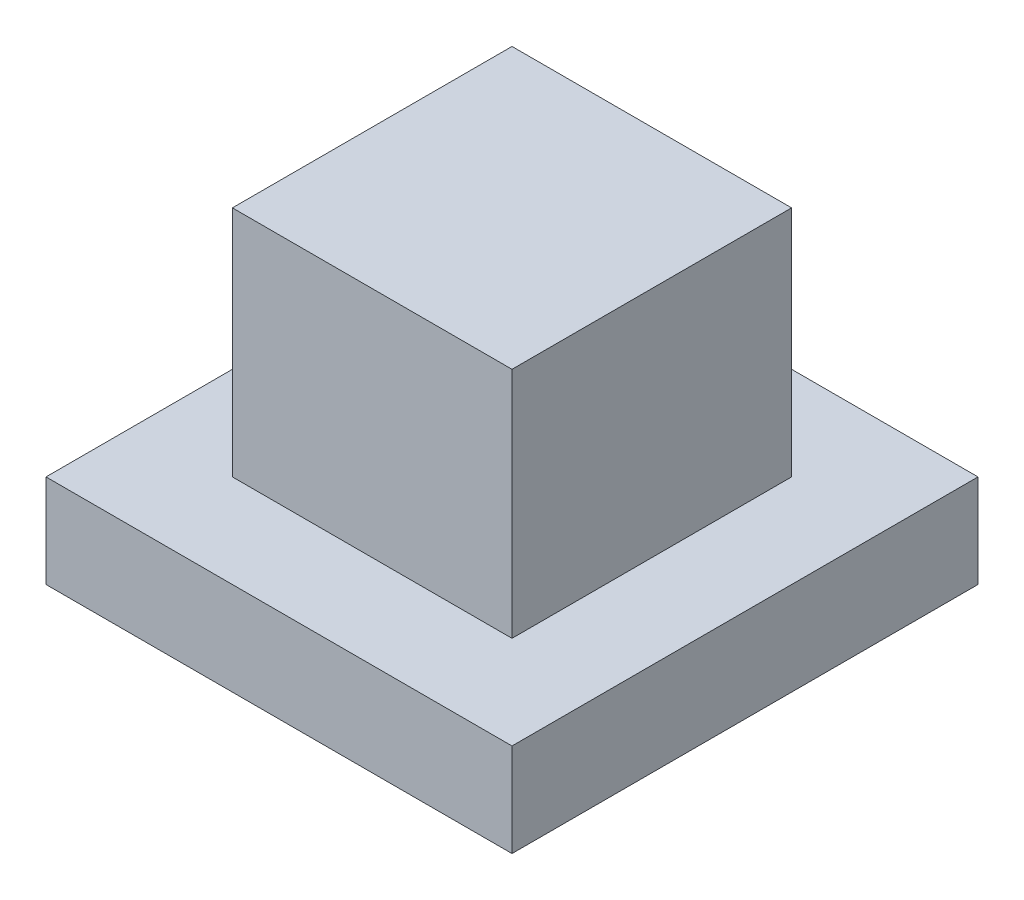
ISO-10303-21;
HEADER;
FILE_DESCRIPTION(('STEP AP214'),'2;1');
FILE_NAME('part.step','',(''),(''),'','','');
FILE_SCHEMA(('AUTOMOTIVE_DESIGN { 1 0 10303 214 1 1 1 1 }'));
ENDSEC;
DATA;
#1=APPLICATION_CONTEXT('core data for automotive mechanical design processes');
#2=APPLICATION_PROTOCOL_DEFINITION('international standard','automotive_design',2000,#1);
#3=PRODUCT_CONTEXT('',#1,'mechanical');
#4=PRODUCT('Part','Part','',(#3));
#5=PRODUCT_RELATED_PRODUCT_CATEGORY('part','',(#4));
#6=PRODUCT_DEFINITION_FORMATION('','',#4);
#7=PRODUCT_DEFINITION_CONTEXT('part definition',#1,'design');
#8=PRODUCT_DEFINITION('design','',#6,#7);
#9=PRODUCT_DEFINITION_SHAPE('','',#8);
#10=(LENGTH_UNIT() NAMED_UNIT(*) SI_UNIT(.MILLI.,.METRE.));
#11=(NAMED_UNIT(*) PLANE_ANGLE_UNIT() SI_UNIT($,.RADIAN.));
#12=(NAMED_UNIT(*) SI_UNIT($,.STERADIAN.) SOLID_ANGLE_UNIT());
#13=UNCERTAINTY_MEASURE_WITH_UNIT(LENGTH_MEASURE(1.E-05),#10,'distance_accuracy_value','');
#14=(GEOMETRIC_REPRESENTATION_CONTEXT(3) GLOBAL_UNCERTAINTY_ASSIGNED_CONTEXT((#13)) GLOBAL_UNIT_ASSIGNED_CONTEXT((#10,
#11,#12)) REPRESENTATION_CONTEXT('',''));
#15=CARTESIAN_POINT('',(0.,0.,0.));
#16=DIRECTION('',(0.,0.,1.));
#17=DIRECTION('',(1.,0.,0.));
#18=AXIS2_PLACEMENT_3D('',#15,#16,#17);
#19=CARTESIAN_POINT('',(-50.,20.,50.));
#20=DIRECTION('',(0.,-1.,0.));
#21=DIRECTION('',(1.,0.,0.));
#22=AXIS2_PLACEMENT_3D('',#19,#20,#21);
#23=PLANE('',#22);
#24=DIRECTION('',(-1.,0.,0.));
#25=VECTOR('',#24,1.);
#26=CARTESIAN_POINT('',(-50.,20.,-50.));
#27=LINE('',#26,#25);
#28=CARTESIAN_POINT('',(50.,20.,-50.));
#29=VERTEX_POINT('',#28);
#30=CARTESIAN_POINT('',(-50.,20.,-50.));
#31=VERTEX_POINT('',#30);
#32=EDGE_CURVE('E131',#29,#31,#27,.T.);
#33=ORIENTED_EDGE('',*,*,#32,.T.);
#34=DIRECTION('',(0.,0.,-1.));
#35=VECTOR('',#34,1.);
#36=CARTESIAN_POINT('',(-50.,20.,50.));
#37=LINE('',#36,#35);
#38=CARTESIAN_POINT('',(-50.,20.,50.));
#39=VERTEX_POINT('',#38);
#40=EDGE_CURVE('E142',#39,#31,#37,.T.);
#41=ORIENTED_EDGE('',*,*,#40,.F.);
#42=DIRECTION('',(-1.,0.,0.));
#43=VECTOR('',#42,1.);
#44=CARTESIAN_POINT('',(-50.,20.,50.));
#45=LINE('',#44,#43);
#46=CARTESIAN_POINT('',(50.,20.,50.));
#47=VERTEX_POINT('',#46);
#48=EDGE_CURVE('E140',#47,#39,#45,.T.);
#49=ORIENTED_EDGE('',*,*,#48,.F.);
#50=DIRECTION('',(0.,0.,-1.));
#51=VECTOR('',#50,1.);
#52=CARTESIAN_POINT('',(50.,20.,50.));
#53=LINE('',#52,#51);
#54=EDGE_CURVE('E145',#47,#29,#53,.T.);
#55=ORIENTED_EDGE('',*,*,#54,.T.);
#56=EDGE_LOOP('',(#33,#41,#49,#55));
#57=FACE_BOUND('',#56,.T.);
#58=DIRECTION('',(0.,0.,-1.));
#59=VECTOR('',#58,1.);
#60=CARTESIAN_POINT('',(30.,20.,30.));
#61=LINE('',#60,#59);
#62=CARTESIAN_POINT('',(30.,20.,30.));
#63=VERTEX_POINT('',#62);
#64=CARTESIAN_POINT('',(30.,20.,-30.));
#65=VERTEX_POINT('',#64);
#66=EDGE_CURVE('E118',#63,#65,#61,.T.);
#67=ORIENTED_EDGE('',*,*,#66,.F.);
#68=DIRECTION('',(1.,0.,0.));
#69=VECTOR('',#68,1.);
#70=CARTESIAN_POINT('',(30.,20.,30.));
#71=LINE('',#70,#69);
#72=CARTESIAN_POINT('',(-30.,20.,30.));
#73=VERTEX_POINT('',#72);
#74=EDGE_CURVE('E115',#73,#63,#71,.T.);
#75=ORIENTED_EDGE('',*,*,#74,.F.);
#76=DIRECTION('',(0.,0.,1.));
#77=VECTOR('',#76,1.);
#78=CARTESIAN_POINT('',(-30.,20.,30.));
#79=LINE('',#78,#77);
#80=CARTESIAN_POINT('',(-30.,20.,-30.));
#81=VERTEX_POINT('',#80);
#82=EDGE_CURVE('E53',#81,#73,#79,.T.);
#83=ORIENTED_EDGE('',*,*,#82,.F.);
#84=DIRECTION('',(-1.,0.,0.));
#85=VECTOR('',#84,1.);
#86=CARTESIAN_POINT('',(30.,20.,-30.));
#87=LINE('',#86,#85);
#88=EDGE_CURVE('E48',#65,#81,#87,.T.);
#89=ORIENTED_EDGE('',*,*,#88,.F.);
#90=EDGE_LOOP('',(#67,#75,#83,#89));
#91=FACE_BOUND('',#90,.T.);
#92=ADVANCED_FACE('F33',(#57,#91),#23,.F.);
#93=CARTESIAN_POINT('',(-50.,20.,50.));
#94=DIRECTION('',(1.,0.,0.));
#95=DIRECTION('',(0.,1.,0.));
#96=AXIS2_PLACEMENT_3D('',#93,#94,#95);
#97=PLANE('',#96);
#98=DIRECTION('',(0.,-1.,0.));
#99=VECTOR('',#98,1.);
#100=CARTESIAN_POINT('',(-50.,20.,-50.));
#101=LINE('',#100,#99);
#102=CARTESIAN_POINT('',(-50.,0.,-50.));
#103=VERTEX_POINT('',#102);
#104=EDGE_CURVE('E119',#31,#103,#101,.T.);
#105=ORIENTED_EDGE('',*,*,#104,.T.);
#106=DIRECTION('',(0.,0.,-1.));
#107=VECTOR('',#106,1.);
#108=CARTESIAN_POINT('',(-50.,0.,50.));
#109=LINE('',#108,#107);
#110=CARTESIAN_POINT('',(-50.,0.,50.));
#111=VERTEX_POINT('',#110);
#112=EDGE_CURVE('E11',#111,#103,#109,.T.);
#113=ORIENTED_EDGE('',*,*,#112,.F.);
#114=DIRECTION('',(0.,-1.,0.));
#115=VECTOR('',#114,1.);
#116=CARTESIAN_POINT('',(-50.,20.,50.));
#117=LINE('',#116,#115);
#118=EDGE_CURVE('E133',#39,#111,#117,.T.);
#119=ORIENTED_EDGE('',*,*,#118,.F.);
#120=ORIENTED_EDGE('',*,*,#40,.T.);
#121=EDGE_LOOP('',(#105,#113,#119,#120));
#122=FACE_BOUND('',#121,.T.);
#123=ADVANCED_FACE('F35',(#122),#97,.F.);
#124=CARTESIAN_POINT('',(-50.,0.,50.));
#125=DIRECTION('',(0.,1.,0.));
#126=DIRECTION('',(0.,0.,1.));
#127=AXIS2_PLACEMENT_3D('',#124,#125,#126);
#128=PLANE('',#127);
#129=DIRECTION('',(1.,0.,0.));
#130=VECTOR('',#129,1.);
#131=CARTESIAN_POINT('',(-50.,0.,-50.));
#132=LINE('',#131,#130);
#133=CARTESIAN_POINT('',(50.,0.,-50.));
#134=VERTEX_POINT('',#133);
#135=EDGE_CURVE('E122',#103,#134,#132,.T.);
#136=ORIENTED_EDGE('',*,*,#135,.T.);
#137=DIRECTION('',(0.,0.,-1.));
#138=VECTOR('',#137,1.);
#139=CARTESIAN_POINT('',(50.,0.,50.));
#140=LINE('',#139,#138);
#141=CARTESIAN_POINT('',(50.,0.,50.));
#142=VERTEX_POINT('',#141);
#143=EDGE_CURVE('E41',#142,#134,#140,.T.);
#144=ORIENTED_EDGE('',*,*,#143,.F.);
#145=DIRECTION('',(1.,0.,0.));
#146=VECTOR('',#145,1.);
#147=CARTESIAN_POINT('',(-50.,0.,50.));
#148=LINE('',#147,#146);
#149=EDGE_CURVE('E136',#111,#142,#148,.T.);
#150=ORIENTED_EDGE('',*,*,#149,.F.);
#151=ORIENTED_EDGE('',*,*,#112,.T.);
#152=EDGE_LOOP('',(#136,#144,#150,#151));
#153=FACE_BOUND('',#152,.T.);
#154=ADVANCED_FACE('F167',(#153),#128,.F.);
#155=CARTESIAN_POINT('',(50.,20.,50.));
#156=DIRECTION('',(-1.,0.,0.));
#157=DIRECTION('',(0.,0.,1.));
#158=AXIS2_PLACEMENT_3D('',#155,#156,#157);
#159=PLANE('',#158);
#160=DIRECTION('',(0.,1.,0.));
#161=VECTOR('',#160,1.);
#162=CARTESIAN_POINT('',(50.,20.,-50.));
#163=LINE('',#162,#161);
#164=EDGE_CURVE('E129',#134,#29,#163,.T.);
#165=ORIENTED_EDGE('',*,*,#164,.T.);
#166=ORIENTED_EDGE('',*,*,#54,.F.);
#167=DIRECTION('',(0.,1.,0.));
#168=VECTOR('',#167,1.);
#169=CARTESIAN_POINT('',(50.,20.,50.));
#170=LINE('',#169,#168);
#171=EDGE_CURVE('E138',#142,#47,#170,.T.);
#172=ORIENTED_EDGE('',*,*,#171,.F.);
#173=ORIENTED_EDGE('',*,*,#143,.T.);
#174=EDGE_LOOP('',(#165,#166,#172,#173));
#175=FACE_BOUND('',#174,.T.);
#176=ADVANCED_FACE('F152',(#175),#159,.F.);
#177=CARTESIAN_POINT('',(-50.,20.,50.));
#178=DIRECTION('',(0.,0.,1.));
#179=DIRECTION('',(1.,0.,0.));
#180=AXIS2_PLACEMENT_3D('',#177,#178,#179);
#181=PLANE('',#180);
#182=ORIENTED_EDGE('',*,*,#118,.T.);
#183=ORIENTED_EDGE('',*,*,#149,.T.);
#184=ORIENTED_EDGE('',*,*,#171,.T.);
#185=ORIENTED_EDGE('',*,*,#48,.T.);
#186=EDGE_LOOP('',(#182,#183,#184,#185));
#187=FACE_BOUND('',#186,.T.);
#188=ADVANCED_FACE('F166',(#187),#181,.T.);
#189=CARTESIAN_POINT('',(-50.,20.,-50.));
#190=DIRECTION('',(0.,0.,1.));
#191=DIRECTION('',(1.,0.,0.));
#192=AXIS2_PLACEMENT_3D('',#189,#190,#191);
#193=PLANE('',#192);
#194=ORIENTED_EDGE('',*,*,#104,.F.);
#195=ORIENTED_EDGE('',*,*,#32,.F.);
#196=ORIENTED_EDGE('',*,*,#164,.F.);
#197=ORIENTED_EDGE('',*,*,#135,.F.);
#198=EDGE_LOOP('',(#194,#195,#196,#197));
#199=FACE_BOUND('',#198,.T.);
#200=ADVANCED_FACE('F158',(#199),#193,.F.);
#201=CARTESIAN_POINT('',(30.,70.,30.));
#202=DIRECTION('',(-1.,0.,0.));
#203=DIRECTION('',(0.,-1.,0.));
#204=AXIS2_PLACEMENT_3D('',#201,#202,#203);
#205=PLANE('',#204);
#206=ORIENTED_EDGE('',*,*,#66,.T.);
#207=DIRECTION('',(0.,-1.,0.));
#208=VECTOR('',#207,1.);
#209=CARTESIAN_POINT('',(30.,70.,-30.));
#210=LINE('',#209,#208);
#211=CARTESIAN_POINT('',(30.,70.,-30.));
#212=VERTEX_POINT('',#211);
#213=EDGE_CURVE('E99',#212,#65,#210,.T.);
#214=ORIENTED_EDGE('',*,*,#213,.F.);
#215=DIRECTION('',(0.,0.,-1.));
#216=VECTOR('',#215,1.);
#217=CARTESIAN_POINT('',(30.,70.,30.));
#218=LINE('',#217,#216);
#219=CARTESIAN_POINT('',(30.,70.,30.));
#220=VERTEX_POINT('',#219);
#221=EDGE_CURVE('E106',#220,#212,#218,.T.);
#222=ORIENTED_EDGE('',*,*,#221,.F.);
#223=DIRECTION('',(0.,-1.,0.));
#224=VECTOR('',#223,1.);
#225=CARTESIAN_POINT('',(30.,70.,30.));
#226=LINE('',#225,#224);
#227=EDGE_CURVE('E260',#220,#63,#226,.T.);
#228=ORIENTED_EDGE('',*,*,#227,.T.);
#229=EDGE_LOOP('',(#206,#214,#222,#228));
#230=FACE_BOUND('',#229,.T.);
#231=ADVANCED_FACE('F117',(#230),#205,.F.);
#232=CARTESIAN_POINT('',(30.,70.,-30.));
#233=DIRECTION('',(0.,0.,1.));
#234=DIRECTION('',(1.,0.,0.));
#235=AXIS2_PLACEMENT_3D('',#232,#233,#234);
#236=PLANE('',#235);
#237=ORIENTED_EDGE('',*,*,#88,.T.);
#238=DIRECTION('',(0.,-1.,0.));
#239=VECTOR('',#238,1.);
#240=CARTESIAN_POINT('',(-30.,70.,-30.));
#241=LINE('',#240,#239);
#242=CARTESIAN_POINT('',(-30.,70.,-30.));
#243=VERTEX_POINT('',#242);
#244=EDGE_CURVE('E102',#243,#81,#241,.T.);
#245=ORIENTED_EDGE('',*,*,#244,.F.);
#246=DIRECTION('',(-1.,0.,0.));
#247=VECTOR('',#246,1.);
#248=CARTESIAN_POINT('',(30.,70.,-30.));
#249=LINE('',#248,#247);
#250=EDGE_CURVE('E95',#212,#243,#249,.T.);
#251=ORIENTED_EDGE('',*,*,#250,.F.);
#252=ORIENTED_EDGE('',*,*,#213,.T.);
#253=EDGE_LOOP('',(#237,#245,#251,#252));
#254=FACE_BOUND('',#253,.T.);
#255=ADVANCED_FACE('F97',(#254),#236,.F.);
#256=CARTESIAN_POINT('',(-30.,70.,30.));
#257=DIRECTION('',(1.,0.,0.));
#258=DIRECTION('',(0.,1.,0.));
#259=AXIS2_PLACEMENT_3D('',#256,#257,#258);
#260=PLANE('',#259);
#261=ORIENTED_EDGE('',*,*,#82,.T.);
#262=DIRECTION('',(0.,-1.,0.));
#263=VECTOR('',#262,1.);
#264=CARTESIAN_POINT('',(-30.,70.,30.));
#265=LINE('',#264,#263);
#266=CARTESIAN_POINT('',(-30.,70.,30.));
#267=VERTEX_POINT('',#266);
#268=EDGE_CURVE('E124',#267,#73,#265,.T.);
#269=ORIENTED_EDGE('',*,*,#268,.F.);
#270=DIRECTION('',(0.,0.,1.));
#271=VECTOR('',#270,1.);
#272=CARTESIAN_POINT('',(-30.,70.,30.));
#273=LINE('',#272,#271);
#274=EDGE_CURVE('E105',#243,#267,#273,.T.);
#275=ORIENTED_EDGE('',*,*,#274,.F.);
#276=ORIENTED_EDGE('',*,*,#244,.T.);
#277=EDGE_LOOP('',(#261,#269,#275,#276));
#278=FACE_BOUND('',#277,.T.);
#279=ADVANCED_FACE('F187',(#278),#260,.F.);
#280=CARTESIAN_POINT('',(30.,70.,30.));
#281=DIRECTION('',(0.,0.,-1.));
#282=DIRECTION('',(-1.,0.,0.));
#283=AXIS2_PLACEMENT_3D('',#280,#281,#282);
#284=PLANE('',#283);
#285=ORIENTED_EDGE('',*,*,#74,.T.);
#286=ORIENTED_EDGE('',*,*,#227,.F.);
#287=DIRECTION('',(1.,0.,0.));
#288=VECTOR('',#287,1.);
#289=CARTESIAN_POINT('',(30.,70.,30.));
#290=LINE('',#289,#288);
#291=EDGE_CURVE('E111',#267,#220,#290,.T.);
#292=ORIENTED_EDGE('',*,*,#291,.F.);
#293=ORIENTED_EDGE('',*,*,#268,.T.);
#294=EDGE_LOOP('',(#285,#286,#292,#293));
#295=FACE_BOUND('',#294,.T.);
#296=ADVANCED_FACE('F190',(#295),#284,.F.);
#297=CARTESIAN_POINT('',(30.,70.,-30.));
#298=DIRECTION('',(0.,1.,0.));
#299=DIRECTION('',(-1.,0.,0.));
#300=AXIS2_PLACEMENT_3D('',#297,#298,#299);
#301=PLANE('',#300);
#302=ORIENTED_EDGE('',*,*,#221,.T.);
#303=ORIENTED_EDGE('',*,*,#250,.T.);
#304=ORIENTED_EDGE('',*,*,#274,.T.);
#305=ORIENTED_EDGE('',*,*,#291,.T.);
#306=EDGE_LOOP('',(#302,#303,#304,#305));
#307=FACE_BOUND('',#306,.T.);
#308=ADVANCED_FACE('F109',(#307),#301,.T.);
#309=CLOSED_SHELL('',(#92,#123,#154,#176,#188,#200,#231,#255,#279,#296,#308));
#310=MANIFOLD_SOLID_BREP('B2',#309);
#311=ADVANCED_BREP_SHAPE_REPRESENTATION('',(#18,#310),#14);
#312=SHAPE_DEFINITION_REPRESENTATION(#9,#311);
ENDSEC;
END-ISO-10303-21;
